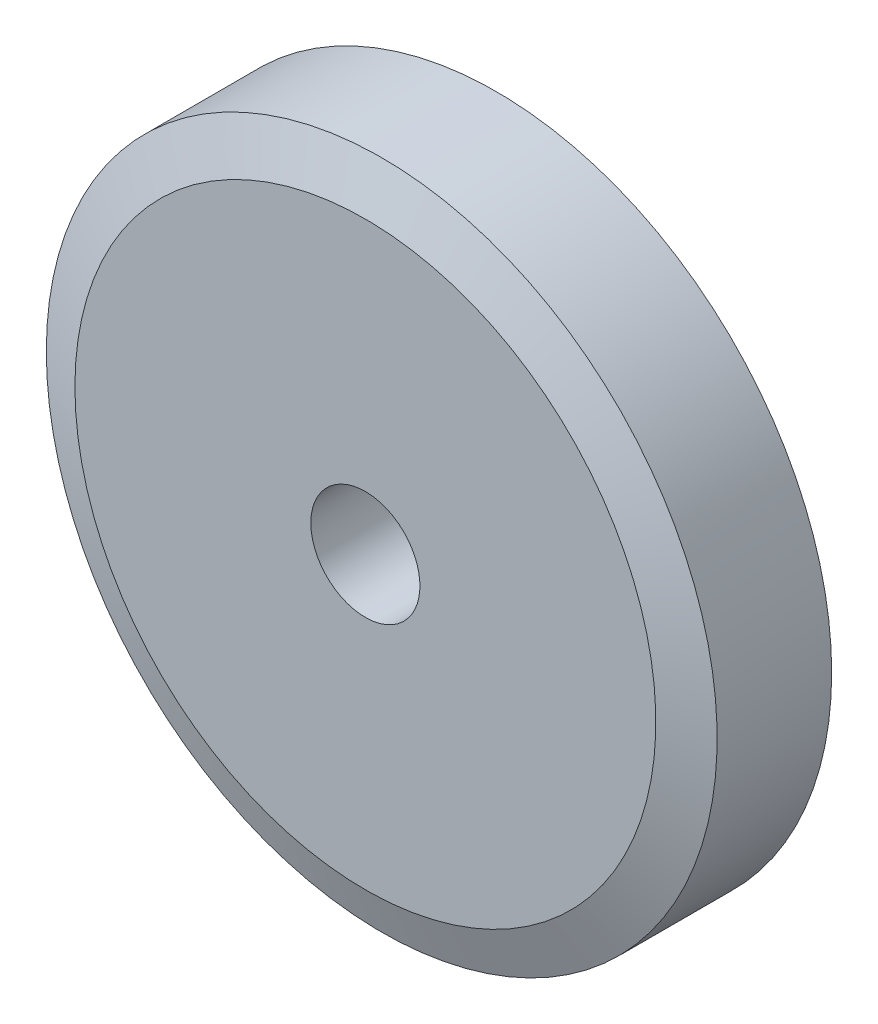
ISO-10303-21;
HEADER;
FILE_DESCRIPTION(('STEP AP214'),'2;1');
FILE_NAME('part.step','',(''),(''),'','','');
FILE_SCHEMA(('AUTOMOTIVE_DESIGN { 1 0 10303 214 1 1 1 1 }'));
ENDSEC;
DATA;
#1=APPLICATION_CONTEXT('core data for automotive mechanical design processes');
#2=APPLICATION_PROTOCOL_DEFINITION('international standard','automotive_design',2000,#1);
#3=PRODUCT_CONTEXT('',#1,'mechanical');
#4=PRODUCT('Part','Part','',(#3));
#5=PRODUCT_RELATED_PRODUCT_CATEGORY('part','',(#4));
#6=PRODUCT_DEFINITION_FORMATION('','',#4);
#7=PRODUCT_DEFINITION_CONTEXT('part definition',#1,'design');
#8=PRODUCT_DEFINITION('design','',#6,#7);
#9=PRODUCT_DEFINITION_SHAPE('','',#8);
#10=(LENGTH_UNIT() NAMED_UNIT(*) SI_UNIT(.MILLI.,.METRE.));
#11=(NAMED_UNIT(*) PLANE_ANGLE_UNIT() SI_UNIT($,.RADIAN.));
#12=(NAMED_UNIT(*) SI_UNIT($,.STERADIAN.) SOLID_ANGLE_UNIT());
#13=UNCERTAINTY_MEASURE_WITH_UNIT(LENGTH_MEASURE(1.E-05),#10,'distance_accuracy_value','');
#14=(GEOMETRIC_REPRESENTATION_CONTEXT(3) GLOBAL_UNCERTAINTY_ASSIGNED_CONTEXT((#13)) GLOBAL_UNIT_ASSIGNED_CONTEXT((#10,
#11,#12)) REPRESENTATION_CONTEXT('',''));
#15=CARTESIAN_POINT('',(0.,0.,0.));
#16=DIRECTION('',(0.,0.,1.));
#17=DIRECTION('',(1.,0.,0.));
#18=AXIS2_PLACEMENT_3D('',#15,#16,#17);
#19=CARTESIAN_POINT('',(0.,0.,10.5));
#20=DIRECTION('',(0.,0.,-1.));
#21=DIRECTION('',(-1.,0.,0.));
#22=AXIS2_PLACEMENT_3D('',#19,#20,#21);
#23=CONICAL_SURFACE('',#22,61.5,1.22173047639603);
#24=CARTESIAN_POINT('',(0.,0.,10.5));
#25=DIRECTION('',(0.,0.,-1.));
#26=DIRECTION('',(-1.,0.,0.));
#27=AXIS2_PLACEMENT_3D('',#24,#25,#26);
#28=CIRCLE('',#27,61.5);
#29=CARTESIAN_POINT('',(-61.5000000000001,0.,10.5));
#30=VERTEX_POINT('',#29);
#31=EDGE_CURVE('E29',#30,#30,#28,.T.);
#32=ORIENTED_EDGE('',*,*,#31,.F.);
#33=EDGE_LOOP('',(#32));
#34=FACE_BOUND('',#33,.T.);
#35=CARTESIAN_POINT('',(0.,0.,13.5));
#36=DIRECTION('',(0.,0.,-1.));
#37=DIRECTION('',(-1.,0.,0.));
#38=AXIS2_PLACEMENT_3D('',#35,#36,#37);
#39=CIRCLE('',#38,53.2575677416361);
#40=CARTESIAN_POINT('',(-53.2575677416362,0.,13.5));
#41=VERTEX_POINT('',#40);
#42=EDGE_CURVE('E17',#41,#41,#39,.F.);
#43=ORIENTED_EDGE('',*,*,#42,.F.);
#44=EDGE_LOOP('',(#43));
#45=FACE_BOUND('',#44,.T.);
#46=ADVANCED_FACE('F13',(#34,#45),#23,.T.);
#47=CARTESIAN_POINT('',(0.,0.,13.5));
#48=DIRECTION('',(0.,0.,-1.));
#49=DIRECTION('',(-1.,0.,0.));
#50=AXIS2_PLACEMENT_3D('',#47,#48,#49);
#51=CYLINDRICAL_SURFACE('',#50,61.5);
#52=ORIENTED_EDGE('',*,*,#31,.T.);
#53=EDGE_LOOP('',(#52));
#54=FACE_BOUND('',#53,.T.);
#55=CARTESIAN_POINT('',(0.,0.,-10.5));
#56=DIRECTION('',(0.,0.,1.));
#57=DIRECTION('',(1.,0.,0.));
#58=AXIS2_PLACEMENT_3D('',#55,#56,#57);
#59=CIRCLE('',#58,61.5);
#60=CARTESIAN_POINT('',(61.5000000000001,0.,-10.5));
#61=VERTEX_POINT('',#60);
#62=EDGE_CURVE('E32',#61,#61,#59,.F.);
#63=ORIENTED_EDGE('',*,*,#62,.F.);
#64=EDGE_LOOP('',(#63));
#65=FACE_BOUND('',#64,.T.);
#66=ADVANCED_FACE('F44',(#54,#65),#51,.T.);
#67=CARTESIAN_POINT('',(0.,0.,13.5));
#68=DIRECTION('',(0.,0.,1.));
#69=DIRECTION('',(1.,0.,0.));
#70=AXIS2_PLACEMENT_3D('',#67,#68,#69);
#71=PLANE('',#70);
#72=CARTESIAN_POINT('',(0.,0.,13.5));
#73=DIRECTION('',(0.,0.,-1.));
#74=DIRECTION('',(-1.,0.,0.));
#75=AXIS2_PLACEMENT_3D('',#72,#73,#74);
#76=CIRCLE('',#75,10.);
#77=CARTESIAN_POINT('',(-10.,0.,13.5));
#78=VERTEX_POINT('',#77);
#79=EDGE_CURVE('E26',#78,#78,#76,.T.);
#80=ORIENTED_EDGE('',*,*,#79,.T.);
#81=EDGE_LOOP('',(#80));
#82=FACE_BOUND('',#81,.T.);
#83=ORIENTED_EDGE('',*,*,#42,.T.);
#84=EDGE_LOOP('',(#83));
#85=FACE_BOUND('',#84,.T.);
#86=ADVANCED_FACE('F54',(#82,#85),#71,.T.);
#87=CARTESIAN_POINT('',(0.,0.,-10.5));
#88=DIRECTION('',(0.,0.,1.));
#89=DIRECTION('',(1.,0.,0.));
#90=AXIS2_PLACEMENT_3D('',#87,#88,#89);
#91=CONICAL_SURFACE('',#90,61.5,1.22173047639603);
#92=CARTESIAN_POINT('',(0.,0.,-13.5));
#93=DIRECTION('',(0.,0.,1.));
#94=DIRECTION('',(1.,0.,0.));
#95=AXIS2_PLACEMENT_3D('',#92,#93,#94);
#96=CIRCLE('',#95,53.2575677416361);
#97=CARTESIAN_POINT('',(53.2575677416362,0.,-13.5));
#98=VERTEX_POINT('',#97);
#99=EDGE_CURVE('E21',#98,#98,#96,.T.);
#100=ORIENTED_EDGE('',*,*,#99,.T.);
#101=EDGE_LOOP('',(#100));
#102=FACE_BOUND('',#101,.T.);
#103=ORIENTED_EDGE('',*,*,#62,.T.);
#104=EDGE_LOOP('',(#103));
#105=FACE_BOUND('',#104,.T.);
#106=ADVANCED_FACE('F62',(#102,#105),#91,.T.);
#107=CARTESIAN_POINT('',(0.,0.,13.5));
#108=DIRECTION('',(0.,0.,-1.));
#109=DIRECTION('',(-1.,0.,0.));
#110=AXIS2_PLACEMENT_3D('',#107,#108,#109);
#111=CYLINDRICAL_SURFACE('',#110,10.);
#112=CARTESIAN_POINT('',(0.,0.,-13.5));
#113=DIRECTION('',(0.,0.,-1.));
#114=DIRECTION('',(-1.,0.,0.));
#115=AXIS2_PLACEMENT_3D('',#112,#113,#114);
#116=CIRCLE('',#115,10.);
#117=CARTESIAN_POINT('',(-10.,0.,-13.5));
#118=VERTEX_POINT('',#117);
#119=EDGE_CURVE('E9',#118,#118,#116,.T.);
#120=ORIENTED_EDGE('',*,*,#119,.T.);
#121=EDGE_LOOP('',(#120));
#122=FACE_BOUND('',#121,.T.);
#123=ORIENTED_EDGE('',*,*,#79,.F.);
#124=EDGE_LOOP('',(#123));
#125=FACE_BOUND('',#124,.T.);
#126=ADVANCED_FACE('F57',(#122,#125),#111,.F.);
#127=CARTESIAN_POINT('',(0.,0.,-13.5));
#128=DIRECTION('',(0.,0.,1.));
#129=DIRECTION('',(1.,0.,0.));
#130=AXIS2_PLACEMENT_3D('',#127,#128,#129);
#131=PLANE('',#130);
#132=ORIENTED_EDGE('',*,*,#119,.F.);
#133=EDGE_LOOP('',(#132));
#134=FACE_BOUND('',#133,.T.);
#135=ORIENTED_EDGE('',*,*,#99,.F.);
#136=EDGE_LOOP('',(#135));
#137=FACE_BOUND('',#136,.T.);
#138=ADVANCED_FACE('F15',(#134,#137),#131,.F.);
#139=CLOSED_SHELL('',(#46,#66,#86,#106,#126,#138));
#140=MANIFOLD_SOLID_BREP('B1',#139);
#141=ADVANCED_BREP_SHAPE_REPRESENTATION('',(#18,#140),#14);
#142=SHAPE_DEFINITION_REPRESENTATION(#9,#141);
ENDSEC;
END-ISO-10303-21;
